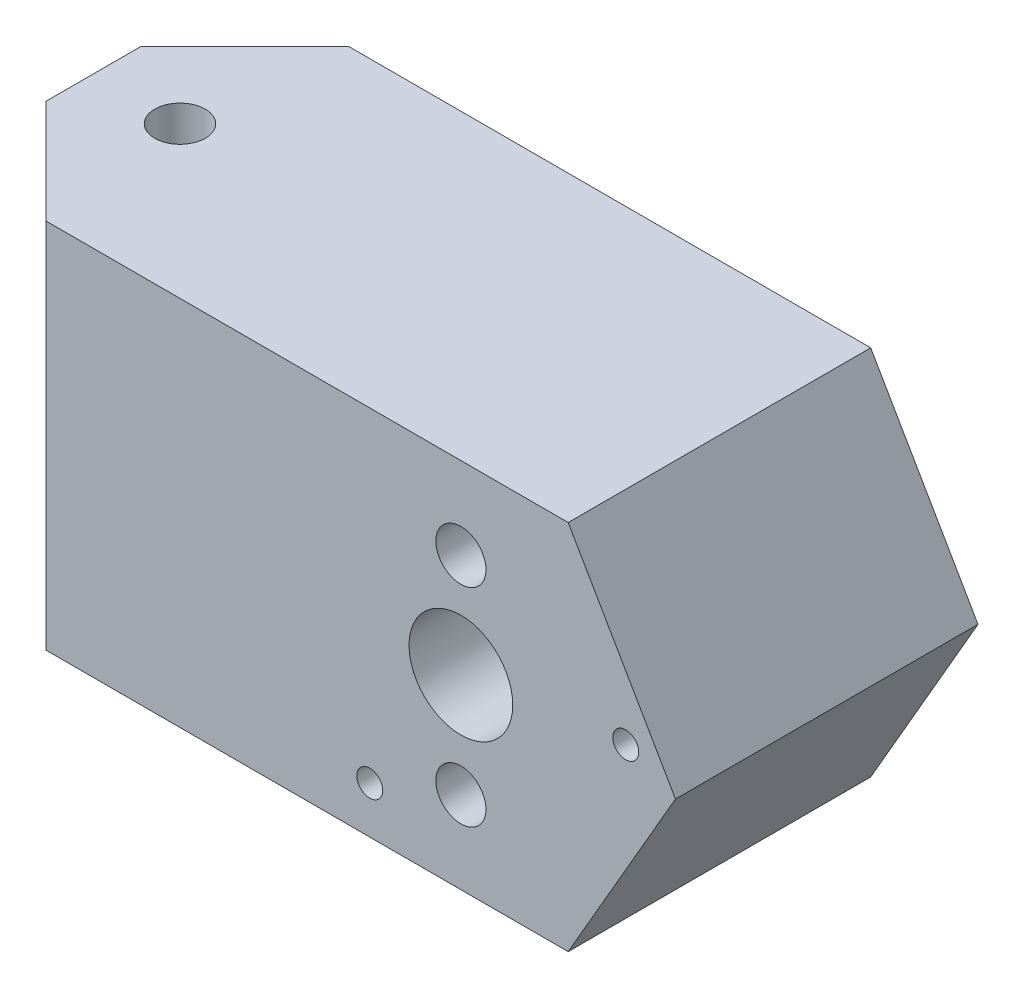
ISO-10303-21;
HEADER;
FILE_DESCRIPTION(('STEP AP214'),'2;1');
FILE_NAME('part.step','',(''),(''),'','','');
FILE_SCHEMA(('AUTOMOTIVE_DESIGN { 1 0 10303 214 1 1 1 1 }'));
ENDSEC;
DATA;
#1=APPLICATION_CONTEXT('core data for automotive mechanical design processes');
#2=APPLICATION_PROTOCOL_DEFINITION('international standard','automotive_design',2000,#1);
#3=PRODUCT_CONTEXT('',#1,'mechanical');
#4=PRODUCT('Part','Part','',(#3));
#5=PRODUCT_RELATED_PRODUCT_CATEGORY('part','',(#4));
#6=PRODUCT_DEFINITION_FORMATION('','',#4);
#7=PRODUCT_DEFINITION_CONTEXT('part definition',#1,'design');
#8=PRODUCT_DEFINITION('design','',#6,#7);
#9=PRODUCT_DEFINITION_SHAPE('','',#8);
#10=(LENGTH_UNIT() NAMED_UNIT(*) SI_UNIT(.MILLI.,.METRE.));
#11=(NAMED_UNIT(*) PLANE_ANGLE_UNIT() SI_UNIT($,.RADIAN.));
#12=(NAMED_UNIT(*) SI_UNIT($,.STERADIAN.) SOLID_ANGLE_UNIT());
#13=UNCERTAINTY_MEASURE_WITH_UNIT(LENGTH_MEASURE(1.E-05),#10,'distance_accuracy_value','');
#14=(GEOMETRIC_REPRESENTATION_CONTEXT(3) GLOBAL_UNCERTAINTY_ASSIGNED_CONTEXT((#13)) GLOBAL_UNIT_ASSIGNED_CONTEXT((#10,
#11,#12)) REPRESENTATION_CONTEXT('',''));
#15=CARTESIAN_POINT('',(0.,0.,0.));
#16=DIRECTION('',(0.,0.,1.));
#17=DIRECTION('',(1.,0.,0.));
#18=AXIS2_PLACEMENT_3D('',#15,#16,#17);
#19=CARTESIAN_POINT('',(0.,0.,17.5));
#20=DIRECTION('',(0.,0.,-1.));
#21=DIRECTION('',(-1.,0.,0.));
#22=AXIS2_PLACEMENT_3D('',#19,#20,#21);
#23=CYLINDRICAL_SURFACE('',#22,8.);
#24=CARTESIAN_POINT('',(0.,0.,-17.5));
#25=DIRECTION('',(0.,0.,1.));
#26=DIRECTION('',(1.,0.,0.));
#27=AXIS2_PLACEMENT_3D('',#24,#25,#26);
#28=CIRCLE('',#27,8.);
#29=CARTESIAN_POINT('',(8.,0.,-17.5));
#30=VERTEX_POINT('',#29);
#31=EDGE_CURVE('E145',#30,#30,#28,.T.);
#32=ORIENTED_EDGE('',*,*,#31,.F.);
#33=EDGE_LOOP('',(#32));
#34=FACE_BOUND('',#33,.T.);
#35=CARTESIAN_POINT('',(0.,0.,7.5));
#36=DIRECTION('',(0.,0.,1.));
#37=DIRECTION('',(1.,0.,0.));
#38=AXIS2_PLACEMENT_3D('',#35,#36,#37);
#39=CIRCLE('',#38,8.);
#40=CARTESIAN_POINT('',(8.,0.,7.5));
#41=VERTEX_POINT('',#40);
#42=EDGE_CURVE('E142',#41,#41,#39,.T.);
#43=ORIENTED_EDGE('',*,*,#42,.T.);
#44=EDGE_LOOP('',(#43));
#45=FACE_BOUND('',#44,.T.);
#46=ADVANCED_FACE('F33',(#34,#45),#23,.F.);
#47=CARTESIAN_POINT('',(0.,0.,17.5));
#48=DIRECTION('',(0.,0.,1.));
#49=DIRECTION('',(1.,0.,0.));
#50=AXIS2_PLACEMENT_3D('',#47,#48,#49);
#51=PLANE('',#50);
#52=CARTESIAN_POINT('',(-10.5437968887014,-16.0959108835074,17.5));
#53=DIRECTION('',(0.,0.,1.));
#54=DIRECTION('',(1.,0.,0.));
#55=AXIS2_PLACEMENT_3D('',#52,#53,#54);
#56=CIRCLE('',#55,1.5);
#57=CARTESIAN_POINT('',(-9.04379688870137,-16.0959108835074,17.5));
#58=VERTEX_POINT('',#57);
#59=EDGE_CURVE('E219',#58,#58,#56,.T.);
#60=ORIENTED_EDGE('',*,*,#59,.F.);
#61=EDGE_LOOP('',(#60));
#62=FACE_BOUND('',#61,.T.);
#63=CARTESIAN_POINT('',(19.071140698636,2.55765370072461,17.5));
#64=DIRECTION('',(0.,0.,1.));
#65=DIRECTION('',(-1.,0.,0.));
#66=AXIS2_PLACEMENT_3D('',#63,#64,#65);
#67=CIRCLE('',#66,1.5);
#68=CARTESIAN_POINT('',(17.571140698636,2.55765370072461,17.5));
#69=VERTEX_POINT('',#68);
#70=EDGE_CURVE('E229',#69,#69,#67,.T.);
#71=ORIENTED_EDGE('',*,*,#70,.F.);
#72=EDGE_LOOP('',(#71));
#73=FACE_BOUND('',#72,.T.);
#74=CARTESIAN_POINT('',(0.,-12.,17.5));
#75=DIRECTION('',(0.,0.,1.));
#76=DIRECTION('',(1.,0.,0.));
#77=AXIS2_PLACEMENT_3D('',#74,#75,#76);
#78=CIRCLE('',#77,2.9);
#79=CARTESIAN_POINT('',(2.9,-12.,17.5));
#80=VERTEX_POINT('',#79);
#81=EDGE_CURVE('E244',#80,#80,#78,.T.);
#82=ORIENTED_EDGE('',*,*,#81,.F.);
#83=EDGE_LOOP('',(#82));
#84=FACE_BOUND('',#83,.T.);
#85=DIRECTION('',(-1.,0.,0.));
#86=VECTOR('',#85,1.);
#87=CARTESIAN_POINT('',(12.4130307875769,21.5,17.5));
#88=LINE('',#87,#86);
#89=CARTESIAN_POINT('',(12.4130307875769,21.5,17.5));
#90=VERTEX_POINT('',#89);
#91=CARTESIAN_POINT('',(-48.,21.5,17.5));
#92=VERTEX_POINT('',#91);
#93=EDGE_CURVE('E120',#90,#92,#88,.T.);
#94=ORIENTED_EDGE('',*,*,#93,.T.);
#95=DIRECTION('',(0.,-1.,0.));
#96=VECTOR('',#95,1.);
#97=CARTESIAN_POINT('',(-48.,-21.5,17.5));
#98=LINE('',#97,#96);
#99=CARTESIAN_POINT('',(-48.,-21.5,17.5));
#100=VERTEX_POINT('',#99);
#101=EDGE_CURVE('E11',#92,#100,#98,.T.);
#102=ORIENTED_EDGE('',*,*,#101,.T.);
#103=DIRECTION('',(1.,0.,0.));
#104=VECTOR('',#103,1.);
#105=CARTESIAN_POINT('',(-12.413030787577,-21.5,17.5));
#106=LINE('',#105,#104);
#107=CARTESIAN_POINT('',(12.413030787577,-21.5,17.5));
#108=VERTEX_POINT('',#107);
#109=EDGE_CURVE('E94',#100,#108,#106,.T.);
#110=ORIENTED_EDGE('',*,*,#109,.T.);
#111=DIRECTION('',(0.5,0.866025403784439,0.));
#112=VECTOR('',#111,1.);
#113=CARTESIAN_POINT('',(12.413030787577,-21.5,17.5));
#114=LINE('',#113,#112);
#115=CARTESIAN_POINT('',(24.8260615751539,0.,17.5));
#116=VERTEX_POINT('',#115);
#117=EDGE_CURVE('E99',#108,#116,#114,.T.);
#118=ORIENTED_EDGE('',*,*,#117,.T.);
#119=DIRECTION('',(-0.5,0.866025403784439,0.));
#120=VECTOR('',#119,1.);
#121=CARTESIAN_POINT('',(24.8260615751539,0.,17.5));
#122=LINE('',#121,#120);
#123=EDGE_CURVE('E118',#116,#90,#122,.T.);
#124=ORIENTED_EDGE('',*,*,#123,.T.);
#125=EDGE_LOOP('',(#94,#102,#110,#118,#124));
#126=FACE_BOUND('',#125,.T.);
#127=CARTESIAN_POINT('',(0.,12.,17.5));
#128=DIRECTION('',(0.,0.,1.));
#129=DIRECTION('',(1.,0.,0.));
#130=AXIS2_PLACEMENT_3D('',#127,#128,#129);
#131=CIRCLE('',#130,2.9);
#132=CARTESIAN_POINT('',(2.9,12.,17.5));
#133=VERTEX_POINT('',#132);
#134=EDGE_CURVE('E128',#133,#133,#131,.T.);
#135=ORIENTED_EDGE('',*,*,#134,.F.);
#136=EDGE_LOOP('',(#135));
#137=FACE_BOUND('',#136,.T.);
#138=CARTESIAN_POINT('',(0.,0.,17.5));
#139=DIRECTION('',(0.,0.,1.));
#140=DIRECTION('',(1.,0.,0.));
#141=AXIS2_PLACEMENT_3D('',#138,#139,#140);
#142=CIRCLE('',#141,6.);
#143=CARTESIAN_POINT('',(6.,0.,17.5));
#144=VERTEX_POINT('',#143);
#145=EDGE_CURVE('E234',#144,#144,#142,.T.);
#146=ORIENTED_EDGE('',*,*,#145,.F.);
#147=EDGE_LOOP('',(#146));
#148=FACE_BOUND('',#147,.T.);
#149=ADVANCED_FACE('F96',(#62,#73,#84,#126,#137,#148),#51,.T.);
#150=CARTESIAN_POINT('',(0.,0.,-17.5));
#151=DIRECTION('',(0.,0.,1.));
#152=DIRECTION('',(1.,0.,0.));
#153=AXIS2_PLACEMENT_3D('',#150,#151,#152);
#154=PLANE('',#153);
#155=CARTESIAN_POINT('',(-10.5437968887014,-16.0959108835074,-17.5));
#156=DIRECTION('',(0.,0.,1.));
#157=DIRECTION('',(1.,0.,0.));
#158=AXIS2_PLACEMENT_3D('',#155,#156,#157);
#159=CIRCLE('',#158,1.5);
#160=CARTESIAN_POINT('',(-9.04379688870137,-16.0959108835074,-17.5));
#161=VERTEX_POINT('',#160);
#162=EDGE_CURVE('E223',#161,#161,#159,.T.);
#163=ORIENTED_EDGE('',*,*,#162,.T.);
#164=EDGE_LOOP('',(#163));
#165=FACE_BOUND('',#164,.T.);
#166=CARTESIAN_POINT('',(19.071140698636,2.55765370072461,-17.5));
#167=DIRECTION('',(0.,0.,1.));
#168=DIRECTION('',(-1.,0.,0.));
#169=AXIS2_PLACEMENT_3D('',#166,#167,#168);
#170=CIRCLE('',#169,1.5);
#171=CARTESIAN_POINT('',(17.571140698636,2.55765370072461,-17.5));
#172=VERTEX_POINT('',#171);
#173=EDGE_CURVE('E231',#172,#172,#170,.T.);
#174=ORIENTED_EDGE('',*,*,#173,.T.);
#175=EDGE_LOOP('',(#174));
#176=FACE_BOUND('',#175,.T.);
#177=DIRECTION('',(1.,0.,0.));
#178=VECTOR('',#177,1.);
#179=CARTESIAN_POINT('',(-12.413030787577,-21.5,-17.5));
#180=LINE('',#179,#178);
#181=CARTESIAN_POINT('',(-48.,-21.5,-17.5));
#182=VERTEX_POINT('',#181);
#183=CARTESIAN_POINT('',(12.413030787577,-21.5,-17.5));
#184=VERTEX_POINT('',#183);
#185=EDGE_CURVE('E109',#182,#184,#180,.T.);
#186=ORIENTED_EDGE('',*,*,#185,.F.);
#187=DIRECTION('',(0.,1.,0.));
#188=VECTOR('',#187,1.);
#189=CARTESIAN_POINT('',(-48.,0.,-17.5));
#190=LINE('',#189,#188);
#191=CARTESIAN_POINT('',(-48.,21.5,-17.5));
#192=VERTEX_POINT('',#191);
#193=EDGE_CURVE('E56',#182,#192,#190,.T.);
#194=ORIENTED_EDGE('',*,*,#193,.T.);
#195=DIRECTION('',(-1.,0.,0.));
#196=VECTOR('',#195,1.);
#197=CARTESIAN_POINT('',(-12.413030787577,21.5,-17.5));
#198=LINE('',#197,#196);
#199=CARTESIAN_POINT('',(12.4130307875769,21.5,-17.5));
#200=VERTEX_POINT('',#199);
#201=EDGE_CURVE('E103',#200,#192,#198,.T.);
#202=ORIENTED_EDGE('',*,*,#201,.F.);
#203=DIRECTION('',(-0.5,0.866025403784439,0.));
#204=VECTOR('',#203,1.);
#205=CARTESIAN_POINT('',(24.8260615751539,0.,-17.5));
#206=LINE('',#205,#204);
#207=CARTESIAN_POINT('',(24.8260615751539,0.,-17.5));
#208=VERTEX_POINT('',#207);
#209=EDGE_CURVE('E130',#208,#200,#206,.T.);
#210=ORIENTED_EDGE('',*,*,#209,.F.);
#211=DIRECTION('',(0.5,0.866025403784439,0.));
#212=VECTOR('',#211,1.);
#213=CARTESIAN_POINT('',(12.413030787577,-21.5,-17.5));
#214=LINE('',#213,#212);
#215=EDGE_CURVE('E127',#184,#208,#214,.T.);
#216=ORIENTED_EDGE('',*,*,#215,.F.);
#217=EDGE_LOOP('',(#186,#194,#202,#210,#216));
#218=FACE_BOUND('',#217,.T.);
#219=CARTESIAN_POINT('',(0.,12.,-17.5));
#220=DIRECTION('',(0.,0.,1.));
#221=DIRECTION('',(1.,0.,0.));
#222=AXIS2_PLACEMENT_3D('',#219,#220,#221);
#223=CIRCLE('',#222,2.9);
#224=CARTESIAN_POINT('',(2.9,12.,-17.5));
#225=VERTEX_POINT('',#224);
#226=EDGE_CURVE('E247',#225,#225,#223,.T.);
#227=ORIENTED_EDGE('',*,*,#226,.T.);
#228=EDGE_LOOP('',(#227));
#229=FACE_BOUND('',#228,.T.);
#230=CARTESIAN_POINT('',(0.,-12.,-17.5));
#231=DIRECTION('',(0.,0.,1.));
#232=DIRECTION('',(1.,0.,0.));
#233=AXIS2_PLACEMENT_3D('',#230,#231,#232);
#234=CIRCLE('',#233,2.9);
#235=CARTESIAN_POINT('',(2.9,-12.,-17.5));
#236=VERTEX_POINT('',#235);
#237=EDGE_CURVE('E243',#236,#236,#234,.T.);
#238=ORIENTED_EDGE('',*,*,#237,.T.);
#239=EDGE_LOOP('',(#238));
#240=FACE_BOUND('',#239,.T.);
#241=ORIENTED_EDGE('',*,*,#31,.T.);
#242=EDGE_LOOP('',(#241));
#243=FACE_BOUND('',#242,.T.);
#244=ADVANCED_FACE('F165',(#165,#176,#218,#229,#240,#243),#154,.F.);
#245=CARTESIAN_POINT('',(-12.413030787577,-21.5,17.5));
#246=DIRECTION('',(0.,1.,0.));
#247=DIRECTION('',(0.,0.,1.));
#248=AXIS2_PLACEMENT_3D('',#245,#246,#247);
#249=PLANE('',#248);
#250=CARTESIAN_POINT('',(-50.,-21.5,0.));
#251=DIRECTION('',(0.,1.,0.));
#252=DIRECTION('',(0.,0.,1.));
#253=AXIS2_PLACEMENT_3D('',#250,#251,#252);
#254=CIRCLE('',#253,2.925);
#255=CARTESIAN_POINT('',(-50.,-21.5,2.925));
#256=VERTEX_POINT('',#255);
#257=EDGE_CURVE('E217',#256,#256,#254,.T.);
#258=ORIENTED_EDGE('',*,*,#257,.T.);
#259=EDGE_LOOP('',(#258));
#260=FACE_BOUND('',#259,.T.);
#261=DIRECTION('',(0.,0.,-1.));
#262=VECTOR('',#261,1.);
#263=CARTESIAN_POINT('',(-60.,-21.5,17.5));
#264=LINE('',#263,#262);
#265=CARTESIAN_POINT('',(-60.,-21.5,5.49999999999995));
#266=VERTEX_POINT('',#265);
#267=CARTESIAN_POINT('',(-60.,-21.5,-5.50000000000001));
#268=VERTEX_POINT('',#267);
#269=EDGE_CURVE('E125',#266,#268,#264,.T.);
#270=ORIENTED_EDGE('',*,*,#269,.T.);
#271=DIRECTION('',(-0.707106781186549,0.,0.707106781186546));
#272=VECTOR('',#271,1.);
#273=CARTESIAN_POINT('',(-60.,-21.5,-5.50000000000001));
#274=LINE('',#273,#272);
#275=EDGE_CURVE('E153',#268,#182,#274,.F.);
#276=ORIENTED_EDGE('',*,*,#275,.T.);
#277=ORIENTED_EDGE('',*,*,#185,.T.);
#278=DIRECTION('',(0.,0.,-1.));
#279=VECTOR('',#278,1.);
#280=CARTESIAN_POINT('',(12.413030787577,-21.5,17.5));
#281=LINE('',#280,#279);
#282=EDGE_CURVE('E106',#108,#184,#281,.T.);
#283=ORIENTED_EDGE('',*,*,#282,.F.);
#284=ORIENTED_EDGE('',*,*,#109,.F.);
#285=DIRECTION('',(-0.707106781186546,0.,-0.707106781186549));
#286=VECTOR('',#285,1.);
#287=CARTESIAN_POINT('',(-48.,-21.5,17.5));
#288=LINE('',#287,#286);
#289=EDGE_CURVE('E151',#100,#266,#288,.T.);
#290=ORIENTED_EDGE('',*,*,#289,.T.);
#291=EDGE_LOOP('',(#270,#276,#277,#283,#284,#290));
#292=FACE_BOUND('',#291,.T.);
#293=ADVANCED_FACE('F108',(#260,#292),#249,.F.);
#294=CARTESIAN_POINT('',(12.413030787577,-21.5,17.5));
#295=DIRECTION('',(-0.866025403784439,0.5,0.));
#296=DIRECTION('',(-0.5,-0.866025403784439,0.));
#297=AXIS2_PLACEMENT_3D('',#294,#295,#296);
#298=PLANE('',#297);
#299=ORIENTED_EDGE('',*,*,#215,.T.);
#300=DIRECTION('',(0.,0.,-1.));
#301=VECTOR('',#300,1.);
#302=CARTESIAN_POINT('',(24.8260615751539,0.,17.5));
#303=LINE('',#302,#301);
#304=EDGE_CURVE('E113',#116,#208,#303,.T.);
#305=ORIENTED_EDGE('',*,*,#304,.F.);
#306=ORIENTED_EDGE('',*,*,#117,.F.);
#307=ORIENTED_EDGE('',*,*,#282,.T.);
#308=EDGE_LOOP('',(#299,#305,#306,#307));
#309=FACE_BOUND('',#308,.T.);
#310=ADVANCED_FACE('F115',(#309),#298,.F.);
#311=CARTESIAN_POINT('',(24.8260615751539,0.,17.5));
#312=DIRECTION('',(-0.866025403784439,-0.5,0.));
#313=DIRECTION('',(0.5,-0.866025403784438,0.));
#314=AXIS2_PLACEMENT_3D('',#311,#312,#313);
#315=PLANE('',#314);
#316=ORIENTED_EDGE('',*,*,#209,.T.);
#317=DIRECTION('',(0.,0.,-1.));
#318=VECTOR('',#317,1.);
#319=CARTESIAN_POINT('',(12.4130307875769,21.5,17.5));
#320=LINE('',#319,#318);
#321=EDGE_CURVE('E138',#90,#200,#320,.T.);
#322=ORIENTED_EDGE('',*,*,#321,.F.);
#323=ORIENTED_EDGE('',*,*,#123,.F.);
#324=ORIENTED_EDGE('',*,*,#304,.T.);
#325=EDGE_LOOP('',(#316,#322,#323,#324));
#326=FACE_BOUND('',#325,.T.);
#327=ADVANCED_FACE('F169',(#326),#315,.F.);
#328=CARTESIAN_POINT('',(-12.413030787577,21.5,17.5));
#329=DIRECTION('',(0.,-1.,0.));
#330=DIRECTION('',(1.,0.,0.));
#331=AXIS2_PLACEMENT_3D('',#328,#329,#330);
#332=PLANE('',#331);
#333=CARTESIAN_POINT('',(-50.,21.5,0.));
#334=DIRECTION('',(0.,-1.,0.));
#335=DIRECTION('',(0.,0.,-1.));
#336=AXIS2_PLACEMENT_3D('',#333,#334,#335);
#337=CIRCLE('',#336,2.925);
#338=CARTESIAN_POINT('',(-50.,21.5,-2.925));
#339=VERTEX_POINT('',#338);
#340=EDGE_CURVE('E220',#339,#339,#337,.T.);
#341=ORIENTED_EDGE('',*,*,#340,.T.);
#342=EDGE_LOOP('',(#341));
#343=FACE_BOUND('',#342,.T.);
#344=ORIENTED_EDGE('',*,*,#201,.T.);
#345=DIRECTION('',(0.707106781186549,0.,-0.707106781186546));
#346=VECTOR('',#345,1.);
#347=CARTESIAN_POINT('',(-60.,21.5,-5.50000000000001));
#348=LINE('',#347,#346);
#349=CARTESIAN_POINT('',(-60.,21.5,-5.50000000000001));
#350=VERTEX_POINT('',#349);
#351=EDGE_CURVE('E41',#192,#350,#348,.F.);
#352=ORIENTED_EDGE('',*,*,#351,.T.);
#353=DIRECTION('',(0.,0.,-1.));
#354=VECTOR('',#353,1.);
#355=CARTESIAN_POINT('',(-60.,21.5,17.5));
#356=LINE('',#355,#354);
#357=CARTESIAN_POINT('',(-60.,21.5,5.49999999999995));
#358=VERTEX_POINT('',#357);
#359=EDGE_CURVE('E135',#358,#350,#356,.T.);
#360=ORIENTED_EDGE('',*,*,#359,.F.);
#361=DIRECTION('',(0.707106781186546,0.,0.707106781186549));
#362=VECTOR('',#361,1.);
#363=CARTESIAN_POINT('',(-48.,21.5,17.5));
#364=LINE('',#363,#362);
#365=EDGE_CURVE('E48',#358,#92,#364,.T.);
#366=ORIENTED_EDGE('',*,*,#365,.T.);
#367=ORIENTED_EDGE('',*,*,#93,.F.);
#368=ORIENTED_EDGE('',*,*,#321,.T.);
#369=EDGE_LOOP('',(#344,#352,#360,#366,#367,#368));
#370=FACE_BOUND('',#369,.T.);
#371=ADVANCED_FACE('F157',(#343,#370),#332,.F.);
#372=CARTESIAN_POINT('',(-60.,21.5,17.5));
#373=DIRECTION('',(1.,0.,0.));
#374=DIRECTION('',(0.,0.,-1.));
#375=AXIS2_PLACEMENT_3D('',#372,#373,#374);
#376=PLANE('',#375);
#377=ORIENTED_EDGE('',*,*,#359,.T.);
#378=DIRECTION('',(0.,-1.,0.));
#379=VECTOR('',#378,1.);
#380=CARTESIAN_POINT('',(-60.,21.5,-5.50000000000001));
#381=LINE('',#380,#379);
#382=EDGE_CURVE('E148',#350,#268,#381,.T.);
#383=ORIENTED_EDGE('',*,*,#382,.T.);
#384=ORIENTED_EDGE('',*,*,#269,.F.);
#385=DIRECTION('',(0.,1.,0.));
#386=VECTOR('',#385,1.);
#387=CARTESIAN_POINT('',(-60.,21.5,5.49999999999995));
#388=LINE('',#387,#386);
#389=EDGE_CURVE('E112',#266,#358,#388,.T.);
#390=ORIENTED_EDGE('',*,*,#389,.T.);
#391=EDGE_LOOP('',(#377,#383,#384,#390));
#392=FACE_BOUND('',#391,.T.);
#393=ADVANCED_FACE('F161',(#392),#376,.F.);
#394=CARTESIAN_POINT('',(0.,12.,17.5));
#395=DIRECTION('',(0.,0.,-1.));
#396=DIRECTION('',(-1.,0.,0.));
#397=AXIS2_PLACEMENT_3D('',#394,#395,#396);
#398=CYLINDRICAL_SURFACE('',#397,2.9);
#399=ORIENTED_EDGE('',*,*,#134,.T.);
#400=EDGE_LOOP('',(#399));
#401=FACE_BOUND('',#400,.T.);
#402=ORIENTED_EDGE('',*,*,#226,.F.);
#403=EDGE_LOOP('',(#402));
#404=FACE_BOUND('',#403,.T.);
#405=ADVANCED_FACE('F194',(#401,#404),#398,.F.);
#406=CARTESIAN_POINT('',(0.,-12.,17.5));
#407=DIRECTION('',(0.,0.,-1.));
#408=DIRECTION('',(-1.,0.,0.));
#409=AXIS2_PLACEMENT_3D('',#406,#407,#408);
#410=CYLINDRICAL_SURFACE('',#409,2.9);
#411=ORIENTED_EDGE('',*,*,#81,.T.);
#412=EDGE_LOOP('',(#411));
#413=FACE_BOUND('',#412,.T.);
#414=ORIENTED_EDGE('',*,*,#237,.F.);
#415=EDGE_LOOP('',(#414));
#416=FACE_BOUND('',#415,.T.);
#417=ADVANCED_FACE('F191',(#413,#416),#410,.F.);
#418=CARTESIAN_POINT('',(0.,0.,7.5));
#419=DIRECTION('',(0.,0.,1.));
#420=DIRECTION('',(1.,0.,0.));
#421=AXIS2_PLACEMENT_3D('',#418,#419,#420);
#422=PLANE('',#421);
#423=CARTESIAN_POINT('',(0.,0.,7.5));
#424=DIRECTION('',(0.,0.,1.));
#425=DIRECTION('',(1.,0.,0.));
#426=AXIS2_PLACEMENT_3D('',#423,#424,#425);
#427=CIRCLE('',#426,6.);
#428=CARTESIAN_POINT('',(6.,0.,7.5));
#429=VERTEX_POINT('',#428);
#430=EDGE_CURVE('E146',#429,#429,#427,.T.);
#431=ORIENTED_EDGE('',*,*,#430,.T.);
#432=EDGE_LOOP('',(#431));
#433=FACE_BOUND('',#432,.T.);
#434=ORIENTED_EDGE('',*,*,#42,.F.);
#435=EDGE_LOOP('',(#434));
#436=FACE_BOUND('',#435,.T.);
#437=ADVANCED_FACE('F189',(#433,#436),#422,.F.);
#438=CARTESIAN_POINT('',(0.,0.,7.5));
#439=DIRECTION('',(0.,0.,1.));
#440=DIRECTION('',(1.,0.,0.));
#441=AXIS2_PLACEMENT_3D('',#438,#439,#440);
#442=CYLINDRICAL_SURFACE('',#441,6.);
#443=ORIENTED_EDGE('',*,*,#430,.F.);
#444=EDGE_LOOP('',(#443));
#445=FACE_BOUND('',#444,.T.);
#446=ORIENTED_EDGE('',*,*,#145,.T.);
#447=EDGE_LOOP('',(#446));
#448=FACE_BOUND('',#447,.T.);
#449=ADVANCED_FACE('F262',(#445,#448),#442,.F.);
#450=CARTESIAN_POINT('',(19.071140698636,2.55765370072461,-17.5));
#451=DIRECTION('',(0.,0.,1.));
#452=DIRECTION('',(1.,0.,0.));
#453=AXIS2_PLACEMENT_3D('',#450,#451,#452);
#454=CYLINDRICAL_SURFACE('',#453,1.5);
#455=ORIENTED_EDGE('',*,*,#173,.F.);
#456=EDGE_LOOP('',(#455));
#457=FACE_BOUND('',#456,.T.);
#458=ORIENTED_EDGE('',*,*,#70,.T.);
#459=EDGE_LOOP('',(#458));
#460=FACE_BOUND('',#459,.T.);
#461=ADVANCED_FACE('F264',(#457,#460),#454,.F.);
#462=CARTESIAN_POINT('',(-10.5437968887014,-16.0959108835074,-17.5));
#463=DIRECTION('',(0.,0.,1.));
#464=DIRECTION('',(1.,0.,0.));
#465=AXIS2_PLACEMENT_3D('',#462,#463,#464);
#466=CYLINDRICAL_SURFACE('',#465,1.5);
#467=ORIENTED_EDGE('',*,*,#162,.F.);
#468=EDGE_LOOP('',(#467));
#469=FACE_BOUND('',#468,.T.);
#470=ORIENTED_EDGE('',*,*,#59,.T.);
#471=EDGE_LOOP('',(#470));
#472=FACE_BOUND('',#471,.T.);
#473=ADVANCED_FACE('F270',(#469,#472),#466,.F.);
#474=CARTESIAN_POINT('',(-50.,21.5,0.));
#475=DIRECTION('',(0.,-1.,0.));
#476=DIRECTION('',(0.,0.,-1.));
#477=AXIS2_PLACEMENT_3D('',#474,#475,#476);
#478=CYLINDRICAL_SURFACE('',#477,2.925);
#479=ORIENTED_EDGE('',*,*,#340,.F.);
#480=EDGE_LOOP('',(#479));
#481=FACE_BOUND('',#480,.T.);
#482=ORIENTED_EDGE('',*,*,#257,.F.);
#483=EDGE_LOOP('',(#482));
#484=FACE_BOUND('',#483,.T.);
#485=ADVANCED_FACE('F176',(#481,#484),#478,.F.);
#486=CARTESIAN_POINT('',(-60.,21.5,-5.50000000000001));
#487=DIRECTION('',(0.707106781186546,0.,0.707106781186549));
#488=DIRECTION('',(0.,-1.,0.));
#489=AXIS2_PLACEMENT_3D('',#486,#487,#488);
#490=PLANE('',#489);
#491=ORIENTED_EDGE('',*,*,#351,.F.);
#492=ORIENTED_EDGE('',*,*,#193,.F.);
#493=ORIENTED_EDGE('',*,*,#275,.F.);
#494=ORIENTED_EDGE('',*,*,#382,.F.);
#495=EDGE_LOOP('',(#491,#492,#493,#494));
#496=FACE_BOUND('',#495,.T.);
#497=ADVANCED_FACE('F164',(#496),#490,.F.);
#498=CARTESIAN_POINT('',(-48.,0.,17.5));
#499=DIRECTION('',(-0.707106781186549,0.,0.707106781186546));
#500=DIRECTION('',(0.,1.,0.));
#501=AXIS2_PLACEMENT_3D('',#498,#499,#500);
#502=PLANE('',#501);
#503=ORIENTED_EDGE('',*,*,#365,.F.);
#504=ORIENTED_EDGE('',*,*,#389,.F.);
#505=ORIENTED_EDGE('',*,*,#289,.F.);
#506=ORIENTED_EDGE('',*,*,#101,.F.);
#507=EDGE_LOOP('',(#503,#504,#505,#506));
#508=FACE_BOUND('',#507,.T.);
#509=ADVANCED_FACE('F35',(#508),#502,.T.);
#510=CLOSED_SHELL('',(#46,#149,#244,#293,#310,#327,#371,#393,#405,#417,#437,#449,#461,#473,#485,
#497,#509));
#511=MANIFOLD_SOLID_BREP('B2',#510);
#512=ADVANCED_BREP_SHAPE_REPRESENTATION('',(#18,#511),#14);
#513=SHAPE_DEFINITION_REPRESENTATION(#9,#512);
ENDSEC;
END-ISO-10303-21;
